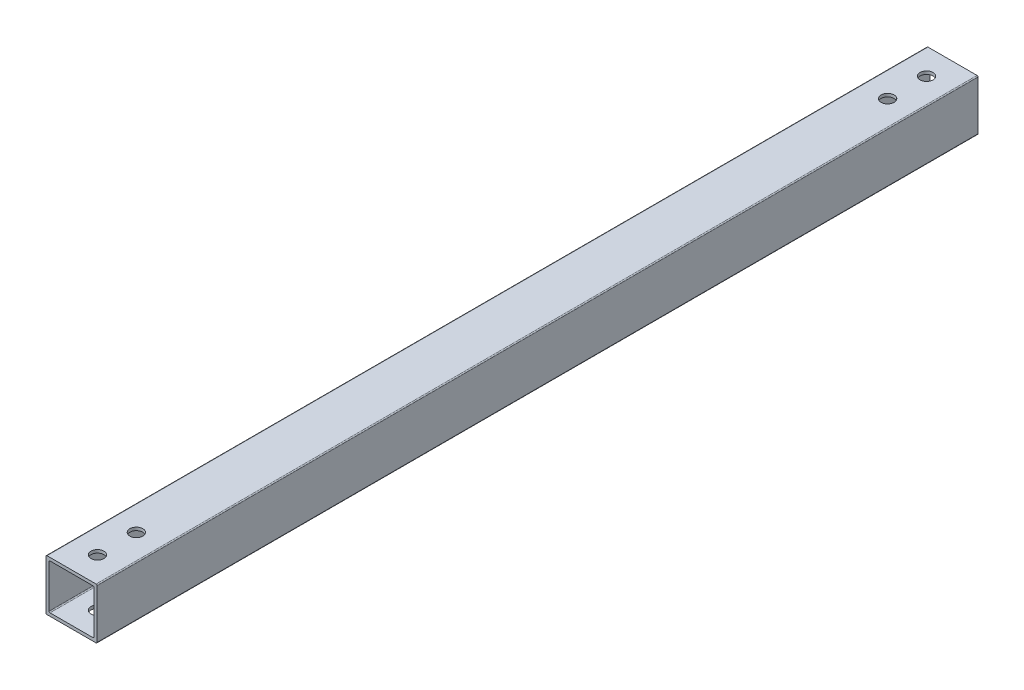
from build123d import *

# Parameters (mm, degrees)
BOSS_EXTRUDE1_DEPTH = 431.4
CUT_EXTRUDE1_REACH  = 2002.195
SKETCH2_R           = 3.175


with BuildPart() as part:
    # Sketch1 → Boss-Extrude1 (new body)
    with BuildSketch(Plane(origin=(0, 0, -2000), x_dir=(-1, 0, 0), z_dir=(0, 0, -1))):
        with BuildLine():
            Line((12.5, -12), (12.5, 12))
            ThreePointArc((12.5, 12), (12.353553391, 12.353553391), (12, 12.5))
            Line((12, 12.5), (-12, 12.5))
            ThreePointArc((-12, 12.5), (-12.353553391, 12.353553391), (-12.5, 12))
            Line((-12.5, 12), (-12.5, -12))
            ThreePointArc((-12.5, -12), (-12.353553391, -12.353553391), (-12, -12.5))
            Line((-12, -12.5), (12, -12.5))
            ThreePointArc((12, -12.5), (12.353553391, -12.353553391), (12.5, -12))
        make_face()
        with BuildLine():
            Line((11, 10.5), (11, -10.5))
            ThreePointArc((11, -10.5), (10.853553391, -10.853553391), (10.5, -11))
            Line((10.5, -11), (-10.5, -11))
            ThreePointArc((-10.5, -11), (-10.853553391, -10.853553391), (-11, -10.5))
            Line((-11, -10.5), (-11, 10.5))
            ThreePointArc((-11, 10.5), (-10.853553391, 10.853553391), (-10.5, 11))
            Line((-10.5, 11), (10.5, 11))
            ThreePointArc((10.5, 11), (10.853553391, 10.853553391), (11, 10.5))
        make_face(mode=Mode.SUBTRACT)
    extrude(amount=-BOSS_EXTRUDE1_DEPTH)

    # Cut-Extrude1: up to this face of the body (flat: up to its plane)
    cut_extrude1_end = Plane(part.part.faces().sort_by_distance((0, -12.5, -1784.3))[0])
    # Sketch2 → Cut-Extrude1 (cut, up to the picked face)
    with BuildSketch(Plane(origin=(0, 12.5, 0), x_dir=(1, 0, 0), z_dir=(0, 1, 0)), mode=Mode.PRIVATE) as cut_extrude1_sk1:
        with Locations(Location((0, 1987.3, 0), (0, 0, 180))):
            Circle(SKETCH2_R)
    cut_extrude1_tool1 = split(extrude(cut_extrude1_sk1.sketch, amount=-CUT_EXTRUDE1_REACH, mode=Mode.PRIVATE), bisect_by=cut_extrude1_end, keep=Keep.BOTH, mode=Mode.PRIVATE)
    # Sketch2 → Cut-Extrude1 (cut, up to the picked face)
    with BuildSketch(Plane(origin=(0, 12.5, 0), x_dir=(1, 0, 0), z_dir=(0, 1, 0)), mode=Mode.PRIVATE) as cut_extrude1_sk2:
        with Locations(Location((0, 1968.25, 0), (0, 0, 180))):
            Circle(SKETCH2_R)
    cut_extrude1_tool2 = split(extrude(cut_extrude1_sk2.sketch, amount=-CUT_EXTRUDE1_REACH, mode=Mode.PRIVATE), bisect_by=cut_extrude1_end, keep=Keep.BOTH, mode=Mode.PRIVATE)
    # Sketch2 → Cut-Extrude1 (cut, up to the picked face)
    with BuildSketch(Plane(origin=(0, 12.5, 0), x_dir=(1, 0, 0), z_dir=(0, 1, 0)), mode=Mode.PRIVATE) as cut_extrude1_sk3:
        with Locations(Location((0, 1600.35, 0), (0, 0, 180))):
            Circle(SKETCH2_R)
    cut_extrude1_tool3 = split(extrude(cut_extrude1_sk3.sketch, amount=-CUT_EXTRUDE1_REACH, mode=Mode.PRIVATE), bisect_by=cut_extrude1_end, keep=Keep.BOTH, mode=Mode.PRIVATE)
    # Sketch2 → Cut-Extrude1 (cut, up to the picked face)
    with BuildSketch(Plane(origin=(0, 12.5, 0), x_dir=(1, 0, 0), z_dir=(0, 1, 0)), mode=Mode.PRIVATE) as cut_extrude1_sk4:
        with Locations(Location((0, 1581.3, 0), (0, 0, 180))):
            Circle(SKETCH2_R)
    cut_extrude1_tool4 = split(extrude(cut_extrude1_sk4.sketch, amount=-CUT_EXTRUDE1_REACH, mode=Mode.PRIVATE), bisect_by=cut_extrude1_end, keep=Keep.BOTH, mode=Mode.PRIVATE)
    add(cut_extrude1_tool1.solids().sort_by(Axis((0, 12.5, -1987.3), (0, -1, 0)))[0], mode=Mode.SUBTRACT)
    add(cut_extrude1_tool2.solids().sort_by(Axis((0, 12.5, -1968.25), (0, -1, 0)))[0], mode=Mode.SUBTRACT)
    add(cut_extrude1_tool3.solids().sort_by(Axis((0, 12.5, -1600.35), (0, -1, 0)))[0], mode=Mode.SUBTRACT)
    add(cut_extrude1_tool4.solids().sort_by(Axis((0, 12.5, -1581.3), (0, -1, 0)))[0], mode=Mode.SUBTRACT)


solid = part.part
